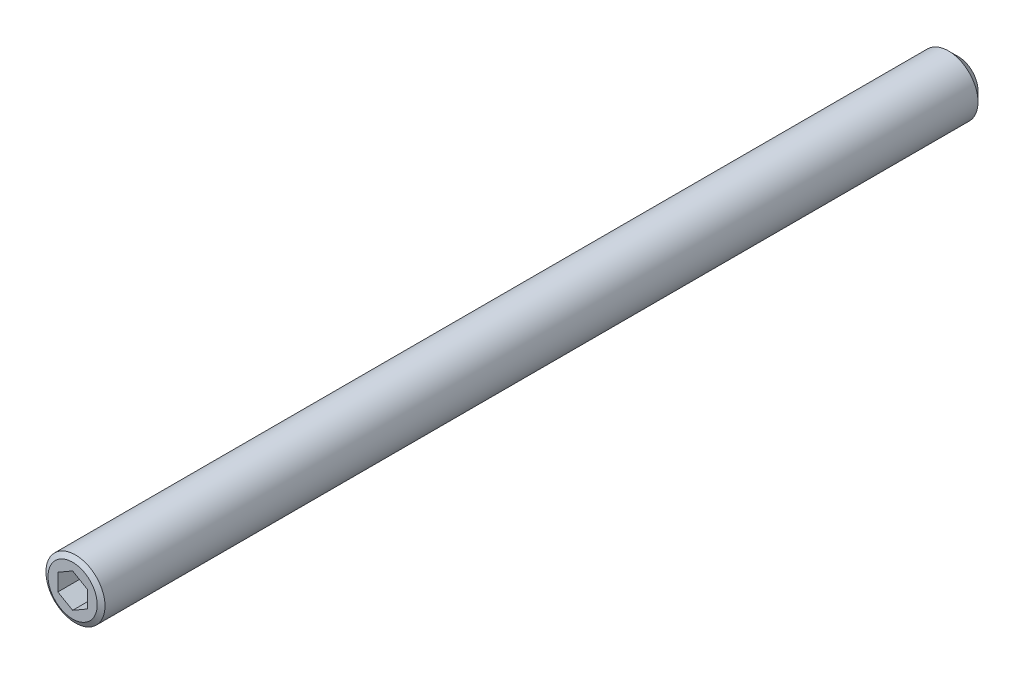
ISO-10303-21;
HEADER;
FILE_DESCRIPTION(('STEP AP214'),'2;1');
FILE_NAME('part.step','',(''),(''),'','','');
FILE_SCHEMA(('AUTOMOTIVE_DESIGN { 1 0 10303 214 1 1 1 1 }'));
ENDSEC;
DATA;
#1=APPLICATION_CONTEXT('core data for automotive mechanical design processes');
#2=APPLICATION_PROTOCOL_DEFINITION('international standard','automotive_design',2000,#1);
#3=PRODUCT_CONTEXT('',#1,'mechanical');
#4=PRODUCT('Part','Part','',(#3));
#5=PRODUCT_RELATED_PRODUCT_CATEGORY('part','',(#4));
#6=PRODUCT_DEFINITION_FORMATION('','',#4);
#7=PRODUCT_DEFINITION_CONTEXT('part definition',#1,'design');
#8=PRODUCT_DEFINITION('design','',#6,#7);
#9=PRODUCT_DEFINITION_SHAPE('','',#8);
#10=(LENGTH_UNIT() NAMED_UNIT(*) SI_UNIT(.MILLI.,.METRE.));
#11=(NAMED_UNIT(*) PLANE_ANGLE_UNIT() SI_UNIT($,.RADIAN.));
#12=(NAMED_UNIT(*) SI_UNIT($,.STERADIAN.) SOLID_ANGLE_UNIT());
#13=UNCERTAINTY_MEASURE_WITH_UNIT(LENGTH_MEASURE(1.E-05),#10,'distance_accuracy_value','');
#14=(GEOMETRIC_REPRESENTATION_CONTEXT(3) GLOBAL_UNCERTAINTY_ASSIGNED_CONTEXT((#13)) GLOBAL_UNIT_ASSIGNED_CONTEXT((#10,
#11,#12)) REPRESENTATION_CONTEXT('',''));
#15=CARTESIAN_POINT('',(0.,0.,0.));
#16=DIRECTION('',(0.,0.,1.));
#17=DIRECTION('',(1.,0.,0.));
#18=AXIS2_PLACEMENT_3D('',#15,#16,#17);
#19=CARTESIAN_POINT('',(0.,0.,90.));
#20=DIRECTION('',(0.,0.,-1.));
#21=DIRECTION('',(-1.,0.,0.));
#22=AXIS2_PLACEMENT_3D('',#19,#20,#21);
#23=CYLINDRICAL_SURFACE('',#22,3.);
#24=CARTESIAN_POINT('',(0.,0.,89.7113248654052));
#25=DIRECTION('',(0.,0.,1.));
#26=DIRECTION('',(1.,0.,0.));
#27=AXIS2_PLACEMENT_3D('',#24,#25,#26);
#28=CIRCLE('',#27,3.);
#29=CARTESIAN_POINT('',(3.,0.,89.7113248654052));
#30=VERTEX_POINT('',#29);
#31=EDGE_CURVE('E9',#30,#30,#28,.F.);
#32=ORIENTED_EDGE('',*,*,#31,.T.);
#33=EDGE_LOOP('',(#32));
#34=FACE_BOUND('',#33,.T.);
#35=CARTESIAN_POINT('',(0.,0.,1.00000000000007));
#36=DIRECTION('',(0.,0.,1.));
#37=DIRECTION('',(1.,0.,0.));
#38=AXIS2_PLACEMENT_3D('',#35,#36,#37);
#39=CIRCLE('',#38,3.);
#40=CARTESIAN_POINT('',(3.,0.,1.00000000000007));
#41=VERTEX_POINT('',#40);
#42=EDGE_CURVE('E116',#41,#41,#39,.T.);
#43=ORIENTED_EDGE('',*,*,#42,.T.);
#44=EDGE_LOOP('',(#43));
#45=FACE_BOUND('',#44,.T.);
#46=ADVANCED_FACE('F14',(#34,#45),#23,.T.);
#47=CARTESIAN_POINT('',(0.,0.,90.));
#48=DIRECTION('',(0.,0.,1.));
#49=DIRECTION('',(1.,0.,0.));
#50=AXIS2_PLACEMENT_3D('',#47,#48,#49);
#51=PLANE('',#50);
#52=DIRECTION('',(-0.866025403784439,0.5,0.));
#53=VECTOR('',#52,1.);
#54=CARTESIAN_POINT('',(1.5,0.866025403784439,90.));
#55=LINE('',#54,#53);
#56=CARTESIAN_POINT('',(1.5,0.866025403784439,90.));
#57=VERTEX_POINT('',#56);
#58=CARTESIAN_POINT('',(0.,1.73205080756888,90.));
#59=VERTEX_POINT('',#58);
#60=EDGE_CURVE('E29',#57,#59,#55,.T.);
#61=ORIENTED_EDGE('',*,*,#60,.F.);
#62=DIRECTION('',(0.,1.,0.));
#63=VECTOR('',#62,1.);
#64=CARTESIAN_POINT('',(1.5,-0.866025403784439,90.));
#65=LINE('',#64,#63);
#66=CARTESIAN_POINT('',(1.5,-0.866025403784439,90.));
#67=VERTEX_POINT('',#66);
#68=EDGE_CURVE('E112',#67,#57,#65,.T.);
#69=ORIENTED_EDGE('',*,*,#68,.F.);
#70=DIRECTION('',(0.866025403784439,0.5,0.));
#71=VECTOR('',#70,1.);
#72=CARTESIAN_POINT('',(0.,-1.73205080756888,90.));
#73=LINE('',#72,#71);
#74=CARTESIAN_POINT('',(0.,-1.73205080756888,90.));
#75=VERTEX_POINT('',#74);
#76=EDGE_CURVE('E110',#75,#67,#73,.T.);
#77=ORIENTED_EDGE('',*,*,#76,.F.);
#78=DIRECTION('',(0.866025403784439,-0.5,0.));
#79=VECTOR('',#78,1.);
#80=CARTESIAN_POINT('',(-1.5,-0.866025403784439,90.));
#81=LINE('',#80,#79);
#82=CARTESIAN_POINT('',(-1.5,-0.866025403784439,90.));
#83=VERTEX_POINT('',#82);
#84=EDGE_CURVE('E77',#83,#75,#81,.T.);
#85=ORIENTED_EDGE('',*,*,#84,.F.);
#86=DIRECTION('',(0.,-1.,0.));
#87=VECTOR('',#86,1.);
#88=CARTESIAN_POINT('',(-1.5,0.866025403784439,90.));
#89=LINE('',#88,#87);
#90=CARTESIAN_POINT('',(-1.5,0.866025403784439,90.));
#91=VERTEX_POINT('',#90);
#92=EDGE_CURVE('E106',#91,#83,#89,.T.);
#93=ORIENTED_EDGE('',*,*,#92,.F.);
#94=DIRECTION('',(-0.866025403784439,-0.5,0.));
#95=VECTOR('',#94,1.);
#96=CARTESIAN_POINT('',(0.,1.73205080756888,90.));
#97=LINE('',#96,#95);
#98=EDGE_CURVE('E103',#59,#91,#97,.T.);
#99=ORIENTED_EDGE('',*,*,#98,.F.);
#100=EDGE_LOOP('',(#61,#69,#77,#85,#93,#99));
#101=FACE_BOUND('',#100,.T.);
#102=CARTESIAN_POINT('',(0.,0.,90.));
#103=DIRECTION('',(0.,0.,1.));
#104=DIRECTION('',(1.,0.,0.));
#105=AXIS2_PLACEMENT_3D('',#102,#103,#104);
#106=CIRCLE('',#105,2.5);
#107=CARTESIAN_POINT('',(2.5,0.,90.));
#108=VERTEX_POINT('',#107);
#109=EDGE_CURVE('E22',#108,#108,#106,.T.);
#110=ORIENTED_EDGE('',*,*,#109,.T.);
#111=EDGE_LOOP('',(#110));
#112=FACE_BOUND('',#111,.T.);
#113=ADVANCED_FACE('F129',(#101,#112),#51,.T.);
#114=CARTESIAN_POINT('',(0.,0.,0.));
#115=DIRECTION('',(0.,0.,1.));
#116=DIRECTION('',(1.,0.,0.));
#117=AXIS2_PLACEMENT_3D('',#114,#115,#116);
#118=PLANE('',#117);
#119=CARTESIAN_POINT('',(0.,0.,0.));
#120=DIRECTION('',(0.,0.,1.));
#121=DIRECTION('',(1.,0.,0.));
#122=AXIS2_PLACEMENT_3D('',#119,#120,#121);
#123=CIRCLE('',#122,1.99999999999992);
#124=CARTESIAN_POINT('',(1.99999999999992,0.,0.));
#125=VERTEX_POINT('',#124);
#126=EDGE_CURVE('E124',#125,#125,#123,.F.);
#127=ORIENTED_EDGE('',*,*,#126,.T.);
#128=EDGE_LOOP('',(#127));
#129=FACE_BOUND('',#128,.T.);
#130=ADVANCED_FACE('F143',(#129),#118,.F.);
#131=CARTESIAN_POINT('',(0.,0.,1.00000000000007));
#132=DIRECTION('',(0.,0.,1.));
#133=DIRECTION('',(1.,0.,0.));
#134=AXIS2_PLACEMENT_3D('',#131,#132,#133);
#135=CONICAL_SURFACE('',#134,3.,0.78539816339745);
#136=ORIENTED_EDGE('',*,*,#126,.F.);
#137=EDGE_LOOP('',(#136));
#138=FACE_BOUND('',#137,.T.);
#139=ORIENTED_EDGE('',*,*,#42,.F.);
#140=EDGE_LOOP('',(#139));
#141=FACE_BOUND('',#140,.T.);
#142=ADVANCED_FACE('F133',(#138,#141),#135,.T.);
#143=CARTESIAN_POINT('',(0.,0.,90.));
#144=DIRECTION('',(0.,0.,-1.));
#145=DIRECTION('',(-1.,0.,0.));
#146=AXIS2_PLACEMENT_3D('',#143,#144,#145);
#147=CONICAL_SURFACE('',#146,2.5,1.04719755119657);
#148=ORIENTED_EDGE('',*,*,#31,.F.);
#149=EDGE_LOOP('',(#148));
#150=FACE_BOUND('',#149,.T.);
#151=ORIENTED_EDGE('',*,*,#109,.F.);
#152=EDGE_LOOP('',(#151));
#153=FACE_BOUND('',#152,.T.);
#154=ADVANCED_FACE('F16',(#150,#153),#147,.T.);
#155=CARTESIAN_POINT('',(1.5,0.866025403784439,86.5));
#156=DIRECTION('',(0.5,0.866025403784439,0.));
#157=DIRECTION('',(-0.866025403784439,0.5,0.));
#158=AXIS2_PLACEMENT_3D('',#155,#156,#157);
#159=PLANE('',#158);
#160=ORIENTED_EDGE('',*,*,#60,.T.);
#161=DIRECTION('',(0.,0.,1.));
#162=VECTOR('',#161,1.);
#163=CARTESIAN_POINT('',(0.,1.73205080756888,86.5));
#164=LINE('',#163,#162);
#165=CARTESIAN_POINT('',(0.,1.73205080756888,86.5));
#166=VERTEX_POINT('',#165);
#167=EDGE_CURVE('E59',#166,#59,#164,.T.);
#168=ORIENTED_EDGE('',*,*,#167,.F.);
#169=DIRECTION('',(-0.866025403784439,0.5,0.));
#170=VECTOR('',#169,1.);
#171=CARTESIAN_POINT('',(1.5,0.866025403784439,86.5));
#172=LINE('',#171,#170);
#173=CARTESIAN_POINT('',(1.5,0.866025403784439,86.5));
#174=VERTEX_POINT('',#173);
#175=EDGE_CURVE('E114',#174,#166,#172,.T.);
#176=ORIENTED_EDGE('',*,*,#175,.F.);
#177=DIRECTION('',(0.,0.,1.));
#178=VECTOR('',#177,1.);
#179=CARTESIAN_POINT('',(1.5,0.866025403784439,86.5));
#180=LINE('',#179,#178);
#181=EDGE_CURVE('E37',#174,#57,#180,.T.);
#182=ORIENTED_EDGE('',*,*,#181,.T.);
#183=EDGE_LOOP('',(#160,#168,#176,#182));
#184=FACE_BOUND('',#183,.T.);
#185=ADVANCED_FACE('F132',(#184),#159,.F.);
#186=CARTESIAN_POINT('',(1.5,-0.866025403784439,86.5));
#187=DIRECTION('',(1.,0.,0.));
#188=DIRECTION('',(0.,0.,-1.));
#189=AXIS2_PLACEMENT_3D('',#186,#187,#188);
#190=PLANE('',#189);
#191=ORIENTED_EDGE('',*,*,#68,.T.);
#192=ORIENTED_EDGE('',*,*,#181,.F.);
#193=DIRECTION('',(0.,1.,0.));
#194=VECTOR('',#193,1.);
#195=CARTESIAN_POINT('',(1.5,-0.866025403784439,86.5));
#196=LINE('',#195,#194);
#197=CARTESIAN_POINT('',(1.5,-0.866025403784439,86.5));
#198=VERTEX_POINT('',#197);
#199=EDGE_CURVE('E89',#198,#174,#196,.T.);
#200=ORIENTED_EDGE('',*,*,#199,.F.);
#201=DIRECTION('',(0.,0.,1.));
#202=VECTOR('',#201,1.);
#203=CARTESIAN_POINT('',(1.5,-0.866025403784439,86.5));
#204=LINE('',#203,#202);
#205=EDGE_CURVE('E81',#198,#67,#204,.T.);
#206=ORIENTED_EDGE('',*,*,#205,.T.);
#207=EDGE_LOOP('',(#191,#192,#200,#206));
#208=FACE_BOUND('',#207,.T.);
#209=ADVANCED_FACE('F141',(#208),#190,.F.);
#210=CARTESIAN_POINT('',(0.,-1.73205080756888,86.5));
#211=DIRECTION('',(0.5,-0.866025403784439,0.));
#212=DIRECTION('',(0.866025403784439,0.5,0.));
#213=AXIS2_PLACEMENT_3D('',#210,#211,#212);
#214=PLANE('',#213);
#215=ORIENTED_EDGE('',*,*,#76,.T.);
#216=ORIENTED_EDGE('',*,*,#205,.F.);
#217=DIRECTION('',(0.866025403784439,0.5,0.));
#218=VECTOR('',#217,1.);
#219=CARTESIAN_POINT('',(0.,-1.73205080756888,86.5));
#220=LINE('',#219,#218);
#221=CARTESIAN_POINT('',(0.,-1.73205080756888,86.5));
#222=VERTEX_POINT('',#221);
#223=EDGE_CURVE('E85',#222,#198,#220,.T.);
#224=ORIENTED_EDGE('',*,*,#223,.F.);
#225=DIRECTION('',(0.,0.,1.));
#226=VECTOR('',#225,1.);
#227=CARTESIAN_POINT('',(0.,-1.73205080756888,86.5));
#228=LINE('',#227,#226);
#229=EDGE_CURVE('E70',#222,#75,#228,.T.);
#230=ORIENTED_EDGE('',*,*,#229,.T.);
#231=EDGE_LOOP('',(#215,#216,#224,#230));
#232=FACE_BOUND('',#231,.T.);
#233=ADVANCED_FACE('F86',(#232),#214,.F.);
#234=CARTESIAN_POINT('',(-1.5,-0.866025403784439,86.5));
#235=DIRECTION('',(-0.5,-0.866025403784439,0.));
#236=DIRECTION('',(0.866025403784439,-0.5,0.));
#237=AXIS2_PLACEMENT_3D('',#234,#235,#236);
#238=PLANE('',#237);
#239=ORIENTED_EDGE('',*,*,#84,.T.);
#240=ORIENTED_EDGE('',*,*,#229,.F.);
#241=DIRECTION('',(0.866025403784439,-0.5,0.));
#242=VECTOR('',#241,1.);
#243=CARTESIAN_POINT('',(-1.5,-0.866025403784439,86.5));
#244=LINE('',#243,#242);
#245=CARTESIAN_POINT('',(-1.5,-0.866025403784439,86.5));
#246=VERTEX_POINT('',#245);
#247=EDGE_CURVE('E74',#246,#222,#244,.T.);
#248=ORIENTED_EDGE('',*,*,#247,.F.);
#249=DIRECTION('',(0.,0.,1.));
#250=VECTOR('',#249,1.);
#251=CARTESIAN_POINT('',(-1.5,-0.866025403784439,86.5));
#252=LINE('',#251,#250);
#253=EDGE_CURVE('E82',#246,#83,#252,.T.);
#254=ORIENTED_EDGE('',*,*,#253,.T.);
#255=EDGE_LOOP('',(#239,#240,#248,#254));
#256=FACE_BOUND('',#255,.T.);
#257=ADVANCED_FACE('F72',(#256),#238,.F.);
#258=CARTESIAN_POINT('',(-1.5,0.866025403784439,86.5));
#259=DIRECTION('',(-1.,0.,0.));
#260=DIRECTION('',(0.,0.,1.));
#261=AXIS2_PLACEMENT_3D('',#258,#259,#260);
#262=PLANE('',#261);
#263=ORIENTED_EDGE('',*,*,#92,.T.);
#264=ORIENTED_EDGE('',*,*,#253,.F.);
#265=DIRECTION('',(0.,-1.,0.));
#266=VECTOR('',#265,1.);
#267=CARTESIAN_POINT('',(-1.5,0.866025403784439,86.5));
#268=LINE('',#267,#266);
#269=CARTESIAN_POINT('',(-1.5,0.866025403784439,86.5));
#270=VERTEX_POINT('',#269);
#271=EDGE_CURVE('E95',#270,#246,#268,.T.);
#272=ORIENTED_EDGE('',*,*,#271,.F.);
#273=DIRECTION('',(0.,0.,1.));
#274=VECTOR('',#273,1.);
#275=CARTESIAN_POINT('',(-1.5,0.866025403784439,86.5));
#276=LINE('',#275,#274);
#277=EDGE_CURVE('E119',#270,#91,#276,.T.);
#278=ORIENTED_EDGE('',*,*,#277,.T.);
#279=EDGE_LOOP('',(#263,#264,#272,#278));
#280=FACE_BOUND('',#279,.T.);
#281=ADVANCED_FACE('F163',(#280),#262,.F.);
#282=CARTESIAN_POINT('',(0.,1.73205080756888,86.5));
#283=DIRECTION('',(-0.5,0.866025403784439,0.));
#284=DIRECTION('',(-0.866025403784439,-0.5,0.));
#285=AXIS2_PLACEMENT_3D('',#282,#283,#284);
#286=PLANE('',#285);
#287=ORIENTED_EDGE('',*,*,#98,.T.);
#288=ORIENTED_EDGE('',*,*,#277,.F.);
#289=DIRECTION('',(-0.866025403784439,-0.5,0.));
#290=VECTOR('',#289,1.);
#291=CARTESIAN_POINT('',(0.,1.73205080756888,86.5));
#292=LINE('',#291,#290);
#293=EDGE_CURVE('E97',#166,#270,#292,.T.);
#294=ORIENTED_EDGE('',*,*,#293,.F.);
#295=ORIENTED_EDGE('',*,*,#167,.T.);
#296=EDGE_LOOP('',(#287,#288,#294,#295));
#297=FACE_BOUND('',#296,.T.);
#298=ADVANCED_FACE('F160',(#297),#286,.F.);
#299=CARTESIAN_POINT('',(0.,1.73205080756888,86.5));
#300=DIRECTION('',(0.,0.,1.));
#301=DIRECTION('',(1.,0.,0.));
#302=AXIS2_PLACEMENT_3D('',#299,#300,#301);
#303=PLANE('',#302);
#304=ORIENTED_EDGE('',*,*,#175,.T.);
#305=ORIENTED_EDGE('',*,*,#293,.T.);
#306=ORIENTED_EDGE('',*,*,#271,.T.);
#307=ORIENTED_EDGE('',*,*,#247,.T.);
#308=ORIENTED_EDGE('',*,*,#223,.T.);
#309=ORIENTED_EDGE('',*,*,#199,.T.);
#310=EDGE_LOOP('',(#304,#305,#306,#307,#308,#309));
#311=FACE_BOUND('',#310,.T.);
#312=ADVANCED_FACE('F92',(#311),#303,.T.);
#313=CLOSED_SHELL('',(#46,#113,#130,#142,#154,#185,#209,#233,#257,#281,#298,#312));
#314=MANIFOLD_SOLID_BREP('B1',#313);
#315=ADVANCED_BREP_SHAPE_REPRESENTATION('',(#18,#314),#14);
#316=SHAPE_DEFINITION_REPRESENTATION(#9,#315);
ENDSEC;
END-ISO-10303-21;
